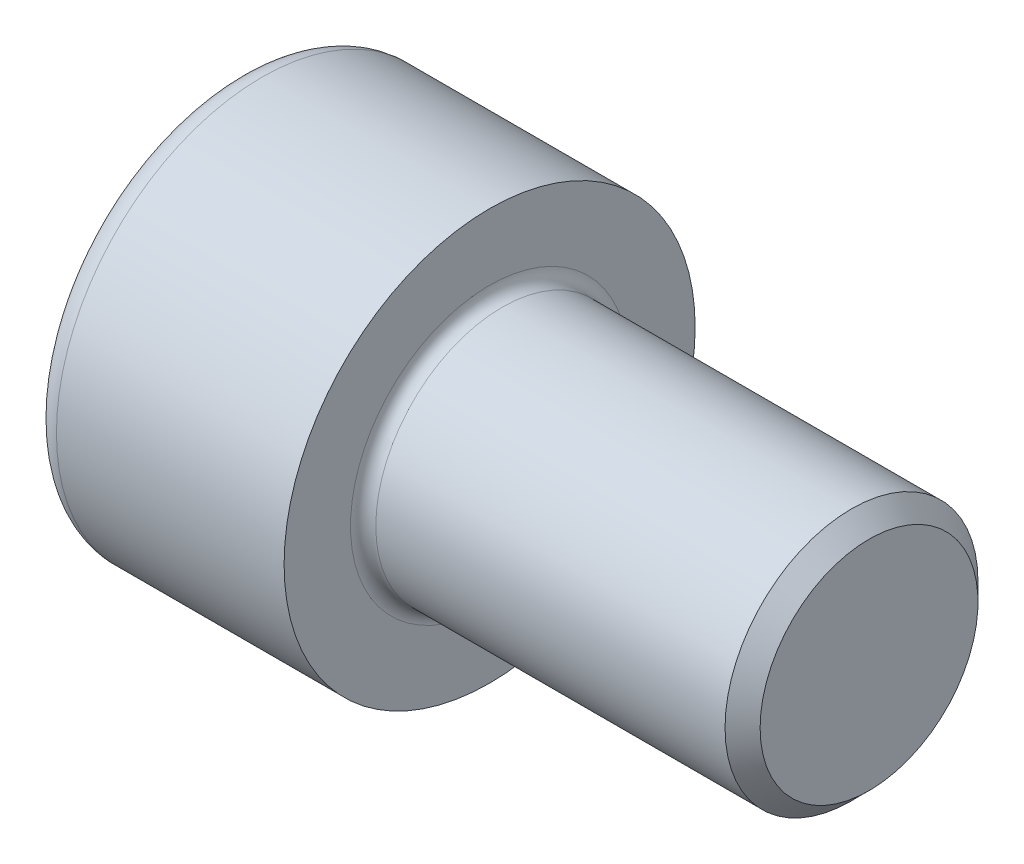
ISO-10303-21;
HEADER;
FILE_DESCRIPTION(('STEP AP214'),'2;1');
FILE_NAME('part.step','',(''),(''),'','','');
FILE_SCHEMA(('AUTOMOTIVE_DESIGN { 1 0 10303 214 1 1 1 1 }'));
ENDSEC;
DATA;
#1=APPLICATION_CONTEXT('core data for automotive mechanical design processes');
#2=APPLICATION_PROTOCOL_DEFINITION('international standard','automotive_design',2000,#1);
#3=PRODUCT_CONTEXT('',#1,'mechanical');
#4=PRODUCT('Part','Part','',(#3));
#5=PRODUCT_RELATED_PRODUCT_CATEGORY('part','',(#4));
#6=PRODUCT_DEFINITION_FORMATION('','',#4);
#7=PRODUCT_DEFINITION_CONTEXT('part definition',#1,'design');
#8=PRODUCT_DEFINITION('design','',#6,#7);
#9=PRODUCT_DEFINITION_SHAPE('','',#8);
#10=(LENGTH_UNIT() NAMED_UNIT(*) SI_UNIT(.MILLI.,.METRE.));
#11=(NAMED_UNIT(*) PLANE_ANGLE_UNIT() SI_UNIT($,.RADIAN.));
#12=(NAMED_UNIT(*) SI_UNIT($,.STERADIAN.) SOLID_ANGLE_UNIT());
#13=UNCERTAINTY_MEASURE_WITH_UNIT(LENGTH_MEASURE(1.E-05),#10,'distance_accuracy_value','');
#14=(GEOMETRIC_REPRESENTATION_CONTEXT(3) GLOBAL_UNCERTAINTY_ASSIGNED_CONTEXT((#13)) GLOBAL_UNIT_ASSIGNED_CONTEXT((#10,
#11,#12)) REPRESENTATION_CONTEXT('',''));
#15=CARTESIAN_POINT('',(0.,0.,0.));
#16=DIRECTION('',(0.,0.,1.));
#17=DIRECTION('',(1.,0.,0.));
#18=AXIS2_PLACEMENT_3D('',#15,#16,#17);
#19=CARTESIAN_POINT('',(0.,0.,0.));
#20=DIRECTION('',(-1.,0.,0.));
#21=DIRECTION('',(0.,0.,1.));
#22=AXIS2_PLACEMENT_3D('',#19,#20,#21);
#23=PLANE('',#22);
#24=DIRECTION('',(0.,-0.499999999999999,0.866025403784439));
#25=VECTOR('',#24,1.);
#26=CARTESIAN_POINT('',(0.,3.47564862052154,0.));
#27=LINE('',#26,#25);
#28=CARTESIAN_POINT('',(0.,3.47564862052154,0.));
#29=VERTEX_POINT('',#28);
#30=CARTESIAN_POINT('',(0.,1.73782431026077,3.00999999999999));
#31=VERTEX_POINT('',#30);
#32=EDGE_CURVE('E259',#29,#31,#27,.T.);
#33=ORIENTED_EDGE('',*,*,#32,.T.);
#34=DIRECTION('',(0.,1.,0.));
#35=VECTOR('',#34,1.);
#36=CARTESIAN_POINT('',(0.,-1.73782431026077,3.01));
#37=LINE('',#36,#35);
#38=CARTESIAN_POINT('',(0.,-1.73782431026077,3.01));
#39=VERTEX_POINT('',#38);
#40=EDGE_CURVE('E131',#39,#31,#37,.T.);
#41=ORIENTED_EDGE('',*,*,#40,.F.);
#42=DIRECTION('',(0.,-0.500000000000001,-0.866025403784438));
#43=VECTOR('',#42,1.);
#44=CARTESIAN_POINT('',(0.,-1.73782431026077,3.01));
#45=LINE('',#44,#43);
#46=CARTESIAN_POINT('',(0.,-3.47564862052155,0.));
#47=VERTEX_POINT('',#46);
#48=EDGE_CURVE('E262',#39,#47,#45,.T.);
#49=ORIENTED_EDGE('',*,*,#48,.T.);
#50=DIRECTION('',(0.,0.499999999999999,-0.866025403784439));
#51=VECTOR('',#50,1.);
#52=CARTESIAN_POINT('',(0.,-3.47564862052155,0.));
#53=LINE('',#52,#51);
#54=CARTESIAN_POINT('',(0.,-1.73782431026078,-3.01));
#55=VERTEX_POINT('',#54);
#56=EDGE_CURVE('E265',#47,#55,#53,.T.);
#57=ORIENTED_EDGE('',*,*,#56,.T.);
#58=DIRECTION('',(0.,-1.,0.));
#59=VECTOR('',#58,1.);
#60=CARTESIAN_POINT('',(0.,1.73782431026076,-3.01));
#61=LINE('',#60,#59);
#62=CARTESIAN_POINT('',(0.,1.73782431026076,-3.01));
#63=VERTEX_POINT('',#62);
#64=EDGE_CURVE('E268',#63,#55,#61,.T.);
#65=ORIENTED_EDGE('',*,*,#64,.F.);
#66=DIRECTION('',(0.,-0.500000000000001,-0.866025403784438));
#67=VECTOR('',#66,1.);
#68=CARTESIAN_POINT('',(0.,3.47564862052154,0.));
#69=LINE('',#68,#67);
#70=EDGE_CURVE('E126',#29,#63,#69,.T.);
#71=ORIENTED_EDGE('',*,*,#70,.F.);
#72=EDGE_LOOP('',(#33,#41,#49,#57,#65,#71));
#73=FACE_BOUND('',#72,.T.);
#74=CARTESIAN_POINT('',(0.,0.,0.));
#75=DIRECTION('',(-1.,0.,0.));
#76=DIRECTION('',(0.,0.,1.));
#77=AXIS2_PLACEMENT_3D('',#74,#75,#76);
#78=CIRCLE('',#77,5.7);
#79=CARTESIAN_POINT('',(0.,0.,5.7));
#80=VERTEX_POINT('',#79);
#81=EDGE_CURVE('E43',#80,#80,#78,.T.);
#82=ORIENTED_EDGE('',*,*,#81,.T.);
#83=EDGE_LOOP('',(#82));
#84=FACE_BOUND('',#83,.T.);
#85=ADVANCED_FACE('F35',(#73,#84),#23,.T.);
#86=CARTESIAN_POINT('',(-31.75,0.,0.));
#87=DIRECTION('',(-1.,0.,0.));
#88=DIRECTION('',(0.,0.,1.));
#89=AXIS2_PLACEMENT_3D('',#86,#87,#88);
#90=CYLINDRICAL_SURFACE('',#89,6.5);
#91=CARTESIAN_POINT('',(0.800000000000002,0.,0.));
#92=DIRECTION('',(-1.,0.,0.));
#93=DIRECTION('',(0.,0.,1.));
#94=AXIS2_PLACEMENT_3D('',#91,#92,#93);
#95=CIRCLE('',#94,6.5);
#96=CARTESIAN_POINT('',(0.800000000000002,0.,6.5));
#97=VERTEX_POINT('',#96);
#98=EDGE_CURVE('E11',#97,#97,#95,.F.);
#99=ORIENTED_EDGE('',*,*,#98,.T.);
#100=EDGE_LOOP('',(#99));
#101=FACE_BOUND('',#100,.T.);
#102=CARTESIAN_POINT('',(8.,0.,0.));
#103=DIRECTION('',(-1.,0.,0.));
#104=DIRECTION('',(0.,0.,1.));
#105=AXIS2_PLACEMENT_3D('',#102,#103,#104);
#106=CIRCLE('',#105,6.5);
#107=CARTESIAN_POINT('',(8.,0.,6.5));
#108=VERTEX_POINT('',#107);
#109=EDGE_CURVE('E149',#108,#108,#106,.T.);
#110=ORIENTED_EDGE('',*,*,#109,.T.);
#111=EDGE_LOOP('',(#110));
#112=FACE_BOUND('',#111,.T.);
#113=ADVANCED_FACE('F173',(#101,#112),#90,.T.);
#114=CARTESIAN_POINT('',(8.,6.5,0.));
#115=DIRECTION('',(1.,0.,0.));
#116=DIRECTION('',(0.,0.,-1.));
#117=AXIS2_PLACEMENT_3D('',#114,#115,#116);
#118=PLANE('',#117);
#119=CARTESIAN_POINT('',(8.,0.,0.));
#120=DIRECTION('',(1.,0.,0.));
#121=DIRECTION('',(0.,0.,-1.));
#122=AXIS2_PLACEMENT_3D('',#119,#120,#121);
#123=CIRCLE('',#122,4.4);
#124=CARTESIAN_POINT('',(8.,0.,-4.4));
#125=VERTEX_POINT('',#124);
#126=EDGE_CURVE('E152',#125,#125,#123,.F.);
#127=ORIENTED_EDGE('',*,*,#126,.T.);
#128=EDGE_LOOP('',(#127));
#129=FACE_BOUND('',#128,.T.);
#130=ORIENTED_EDGE('',*,*,#109,.F.);
#131=EDGE_LOOP('',(#130));
#132=FACE_BOUND('',#131,.T.);
#133=ADVANCED_FACE('F179',(#129,#132),#118,.T.);
#134=CARTESIAN_POINT('',(-31.75,0.,0.));
#135=DIRECTION('',(-1.,0.,0.));
#136=DIRECTION('',(0.,0.,1.));
#137=AXIS2_PLACEMENT_3D('',#134,#135,#136);
#138=CYLINDRICAL_SURFACE('',#137,4.);
#139=CARTESIAN_POINT('',(8.4,0.,0.));
#140=DIRECTION('',(1.,0.,0.));
#141=DIRECTION('',(0.,0.,-1.));
#142=AXIS2_PLACEMENT_3D('',#139,#140,#141);
#143=CIRCLE('',#142,4.);
#144=CARTESIAN_POINT('',(8.4,0.,-4.));
#145=VERTEX_POINT('',#144);
#146=EDGE_CURVE('E155',#145,#145,#143,.T.);
#147=ORIENTED_EDGE('',*,*,#146,.T.);
#148=EDGE_LOOP('',(#147));
#149=FACE_BOUND('',#148,.T.);
#150=CARTESIAN_POINT('',(19.4455,0.,0.));
#151=DIRECTION('',(-1.,0.,0.));
#152=DIRECTION('',(0.,0.,1.));
#153=AXIS2_PLACEMENT_3D('',#150,#151,#152);
#154=CIRCLE('',#153,4.);
#155=CARTESIAN_POINT('',(19.4455,0.,4.));
#156=VERTEX_POINT('',#155);
#157=EDGE_CURVE('E146',#156,#156,#154,.T.);
#158=ORIENTED_EDGE('',*,*,#157,.T.);
#159=EDGE_LOOP('',(#158));
#160=FACE_BOUND('',#159,.T.);
#161=ADVANCED_FACE('F185',(#149,#160),#138,.T.);
#162=CARTESIAN_POINT('',(20.,0.,0.));
#163=DIRECTION('',(-1.,0.,0.));
#164=DIRECTION('',(0.,0.,1.));
#165=AXIS2_PLACEMENT_3D('',#162,#163,#164);
#166=CONICAL_SURFACE('',#165,3.4455,0.785398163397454);
#167=ORIENTED_EDGE('',*,*,#157,.F.);
#168=EDGE_LOOP('',(#167));
#169=FACE_BOUND('',#168,.T.);
#170=CARTESIAN_POINT('',(20.,0.,0.));
#171=DIRECTION('',(-1.,0.,0.));
#172=DIRECTION('',(0.,0.,1.));
#173=AXIS2_PLACEMENT_3D('',#170,#171,#172);
#174=CIRCLE('',#173,3.4455);
#175=CARTESIAN_POINT('',(20.,0.,3.4455));
#176=VERTEX_POINT('',#175);
#177=EDGE_CURVE('E142',#176,#176,#174,.T.);
#178=ORIENTED_EDGE('',*,*,#177,.T.);
#179=EDGE_LOOP('',(#178));
#180=FACE_BOUND('',#179,.T.);
#181=ADVANCED_FACE('F189',(#169,#180),#166,.T.);
#182=CARTESIAN_POINT('',(20.,3.4455,0.));
#183=DIRECTION('',(1.,0.,0.));
#184=DIRECTION('',(0.,0.,-1.));
#185=AXIS2_PLACEMENT_3D('',#182,#183,#184);
#186=PLANE('',#185);
#187=ORIENTED_EDGE('',*,*,#177,.F.);
#188=EDGE_LOOP('',(#187));
#189=FACE_BOUND('',#188,.T.);
#190=ADVANCED_FACE('F169',(#189),#186,.T.);
#191=CARTESIAN_POINT('',(8.4,0.,0.));
#192=DIRECTION('',(1.,0.,0.));
#193=DIRECTION('',(0.,0.,-1.));
#194=AXIS2_PLACEMENT_3D('',#191,#192,#193);
#195=TOROIDAL_SURFACE('',#194,4.4,0.4);
#196=ORIENTED_EDGE('',*,*,#146,.F.);
#197=EDGE_LOOP('',(#196));
#198=FACE_BOUND('',#197,.T.);
#199=ORIENTED_EDGE('',*,*,#126,.F.);
#200=EDGE_LOOP('',(#199));
#201=FACE_BOUND('',#200,.T.);
#202=ADVANCED_FACE('F162',(#198,#201),#195,.F.);
#203=CARTESIAN_POINT('',(0.800000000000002,0.,0.));
#204=DIRECTION('',(-1.,0.,0.));
#205=DIRECTION('',(0.,0.,1.));
#206=AXIS2_PLACEMENT_3D('',#203,#204,#205);
#207=TOROIDAL_SURFACE('',#206,5.7,0.8);
#208=ORIENTED_EDGE('',*,*,#98,.F.);
#209=EDGE_LOOP('',(#208));
#210=FACE_BOUND('',#209,.T.);
#211=ORIENTED_EDGE('',*,*,#81,.F.);
#212=EDGE_LOOP('',(#211));
#213=FACE_BOUND('',#212,.T.);
#214=ADVANCED_FACE('F37',(#210,#213),#207,.T.);
#215=CARTESIAN_POINT('',(4.,3.47564862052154,0.));
#216=DIRECTION('',(0.,-0.866025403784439,-0.499999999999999));
#217=DIRECTION('',(0.,0.499999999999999,-0.866025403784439));
#218=AXIS2_PLACEMENT_3D('',#215,#216,#217);
#219=PLANE('',#218);
#220=ORIENTED_EDGE('',*,*,#32,.F.);
#221=DIRECTION('',(-1.,0.,0.));
#222=VECTOR('',#221,1.);
#223=CARTESIAN_POINT('',(4.,3.47564862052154,0.));
#224=LINE('',#223,#222);
#225=CARTESIAN_POINT('',(4.,3.47564862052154,0.));
#226=VERTEX_POINT('',#225);
#227=EDGE_CURVE('E249',#226,#29,#224,.T.);
#228=ORIENTED_EDGE('',*,*,#227,.F.);
#229=DIRECTION('',(0.,-0.499999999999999,0.866025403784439));
#230=VECTOR('',#229,1.);
#231=CARTESIAN_POINT('',(4.,3.47564862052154,0.));
#232=LINE('',#231,#230);
#233=CARTESIAN_POINT('',(4.,2.60673646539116,1.50499999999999));
#234=VERTEX_POINT('',#233);
#235=EDGE_CURVE('E118',#226,#234,#232,.T.);
#236=ORIENTED_EDGE('',*,*,#235,.T.);
#237=CARTESIAN_POINT('',(4.,1.73782431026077,3.00999999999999));
#238=VERTEX_POINT('',#237);
#239=EDGE_CURVE('E109',#234,#238,#232,.T.);
#240=ORIENTED_EDGE('',*,*,#239,.T.);
#241=DIRECTION('',(-1.,0.,0.));
#242=VECTOR('',#241,1.);
#243=CARTESIAN_POINT('',(4.,1.73782431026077,3.00999999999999));
#244=LINE('',#243,#242);
#245=EDGE_CURVE('E123',#238,#31,#244,.T.);
#246=ORIENTED_EDGE('',*,*,#245,.T.);
#247=EDGE_LOOP('',(#220,#228,#236,#240,#246));
#248=FACE_BOUND('',#247,.T.);
#249=ADVANCED_FACE('F122',(#248),#219,.T.);
#250=CARTESIAN_POINT('',(4.,-1.73782431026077,3.01));
#251=DIRECTION('',(0.,0.,1.));
#252=DIRECTION('',(0.,-1.,0.));
#253=AXIS2_PLACEMENT_3D('',#250,#251,#252);
#254=PLANE('',#253);
#255=ORIENTED_EDGE('',*,*,#40,.T.);
#256=ORIENTED_EDGE('',*,*,#245,.F.);
#257=DIRECTION('',(0.,1.,0.));
#258=VECTOR('',#257,1.);
#259=CARTESIAN_POINT('',(4.,-1.73782431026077,3.01));
#260=LINE('',#259,#258);
#261=CARTESIAN_POINT('',(4.,0.,3.01));
#262=VERTEX_POINT('',#261);
#263=EDGE_CURVE('E106',#262,#238,#260,.T.);
#264=ORIENTED_EDGE('',*,*,#263,.F.);
#265=CARTESIAN_POINT('',(4.,-1.73782431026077,3.01));
#266=VERTEX_POINT('',#265);
#267=EDGE_CURVE('E117',#266,#262,#260,.T.);
#268=ORIENTED_EDGE('',*,*,#267,.F.);
#269=DIRECTION('',(-1.,0.,0.));
#270=VECTOR('',#269,1.);
#271=CARTESIAN_POINT('',(4.,-1.73782431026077,3.01));
#272=LINE('',#271,#270);
#273=EDGE_CURVE('E133',#266,#39,#272,.T.);
#274=ORIENTED_EDGE('',*,*,#273,.T.);
#275=EDGE_LOOP('',(#255,#256,#264,#268,#274));
#276=FACE_BOUND('',#275,.T.);
#277=ADVANCED_FACE('F128',(#276),#254,.F.);
#278=CARTESIAN_POINT('',(4.,-1.73782431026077,3.01));
#279=DIRECTION('',(0.,0.866025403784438,-0.500000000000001));
#280=DIRECTION('',(0.,0.500000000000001,0.866025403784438));
#281=AXIS2_PLACEMENT_3D('',#278,#279,#280);
#282=PLANE('',#281);
#283=ORIENTED_EDGE('',*,*,#48,.F.);
#284=ORIENTED_EDGE('',*,*,#273,.F.);
#285=DIRECTION('',(0.,-0.500000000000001,-0.866025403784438));
#286=VECTOR('',#285,1.);
#287=CARTESIAN_POINT('',(4.,-1.73782431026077,3.01));
#288=LINE('',#287,#286);
#289=CARTESIAN_POINT('',(4.,-2.60673646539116,1.505));
#290=VERTEX_POINT('',#289);
#291=EDGE_CURVE('E288',#266,#290,#288,.T.);
#292=ORIENTED_EDGE('',*,*,#291,.T.);
#293=CARTESIAN_POINT('',(4.,-3.47564862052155,0.));
#294=VERTEX_POINT('',#293);
#295=EDGE_CURVE('E277',#290,#294,#288,.T.);
#296=ORIENTED_EDGE('',*,*,#295,.T.);
#297=DIRECTION('',(-1.,0.,0.));
#298=VECTOR('',#297,1.);
#299=CARTESIAN_POINT('',(4.,-3.47564862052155,0.));
#300=LINE('',#299,#298);
#301=EDGE_CURVE('E138',#294,#47,#300,.T.);
#302=ORIENTED_EDGE('',*,*,#301,.T.);
#303=EDGE_LOOP('',(#283,#284,#292,#296,#302));
#304=FACE_BOUND('',#303,.T.);
#305=ADVANCED_FACE('F203',(#304),#282,.T.);
#306=CARTESIAN_POINT('',(4.,-3.47564862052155,0.));
#307=DIRECTION('',(0.,0.866025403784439,0.499999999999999));
#308=DIRECTION('',(0.,-0.499999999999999,0.866025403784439));
#309=AXIS2_PLACEMENT_3D('',#306,#307,#308);
#310=PLANE('',#309);
#311=ORIENTED_EDGE('',*,*,#56,.F.);
#312=ORIENTED_EDGE('',*,*,#301,.F.);
#313=DIRECTION('',(0.,0.499999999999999,-0.866025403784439));
#314=VECTOR('',#313,1.);
#315=CARTESIAN_POINT('',(4.,-3.47564862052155,0.));
#316=LINE('',#315,#314);
#317=CARTESIAN_POINT('',(4.,-2.60673646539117,-1.505));
#318=VERTEX_POINT('',#317);
#319=EDGE_CURVE('E255',#294,#318,#316,.T.);
#320=ORIENTED_EDGE('',*,*,#319,.T.);
#321=CARTESIAN_POINT('',(4.,-1.73782431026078,-3.01));
#322=VERTEX_POINT('',#321);
#323=EDGE_CURVE('E287',#318,#322,#316,.T.);
#324=ORIENTED_EDGE('',*,*,#323,.T.);
#325=DIRECTION('',(-1.,0.,0.));
#326=VECTOR('',#325,1.);
#327=CARTESIAN_POINT('',(4.,-1.73782431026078,-3.01));
#328=LINE('',#327,#326);
#329=EDGE_CURVE('E248',#322,#55,#328,.T.);
#330=ORIENTED_EDGE('',*,*,#329,.T.);
#331=EDGE_LOOP('',(#311,#312,#320,#324,#330));
#332=FACE_BOUND('',#331,.T.);
#333=ADVANCED_FACE('F206',(#332),#310,.T.);
#334=CARTESIAN_POINT('',(4.,1.73782431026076,-3.01));
#335=DIRECTION('',(0.,0.,-1.));
#336=DIRECTION('',(0.,1.,0.));
#337=AXIS2_PLACEMENT_3D('',#334,#335,#336);
#338=PLANE('',#337);
#339=ORIENTED_EDGE('',*,*,#64,.T.);
#340=ORIENTED_EDGE('',*,*,#329,.F.);
#341=DIRECTION('',(0.,-1.,0.));
#342=VECTOR('',#341,1.);
#343=CARTESIAN_POINT('',(4.,1.73782431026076,-3.01));
#344=LINE('',#343,#342);
#345=CARTESIAN_POINT('',(4.,0.,-3.01));
#346=VERTEX_POINT('',#345);
#347=EDGE_CURVE('E252',#346,#322,#344,.T.);
#348=ORIENTED_EDGE('',*,*,#347,.F.);
#349=CARTESIAN_POINT('',(4.,1.73782431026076,-3.01));
#350=VERTEX_POINT('',#349);
#351=EDGE_CURVE('E50',#350,#346,#344,.T.);
#352=ORIENTED_EDGE('',*,*,#351,.F.);
#353=DIRECTION('',(-1.,0.,0.));
#354=VECTOR('',#353,1.);
#355=CARTESIAN_POINT('',(4.,1.73782431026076,-3.01));
#356=LINE('',#355,#354);
#357=EDGE_CURVE('E245',#350,#63,#356,.T.);
#358=ORIENTED_EDGE('',*,*,#357,.T.);
#359=EDGE_LOOP('',(#339,#340,#348,#352,#358));
#360=FACE_BOUND('',#359,.T.);
#361=ADVANCED_FACE('F210',(#360),#338,.F.);
#362=CARTESIAN_POINT('',(4.,3.47564862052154,0.));
#363=DIRECTION('',(0.,0.866025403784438,-0.500000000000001));
#364=DIRECTION('',(0.,0.500000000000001,0.866025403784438));
#365=AXIS2_PLACEMENT_3D('',#362,#363,#364);
#366=PLANE('',#365);
#367=ORIENTED_EDGE('',*,*,#70,.T.);
#368=ORIENTED_EDGE('',*,*,#357,.F.);
#369=DIRECTION('',(0.,-0.500000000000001,-0.866025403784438));
#370=VECTOR('',#369,1.);
#371=CARTESIAN_POINT('',(4.,3.47564862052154,0.));
#372=LINE('',#371,#370);
#373=CARTESIAN_POINT('',(4.,2.60673646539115,-1.505));
#374=VERTEX_POINT('',#373);
#375=EDGE_CURVE('E235',#374,#350,#372,.T.);
#376=ORIENTED_EDGE('',*,*,#375,.F.);
#377=EDGE_CURVE('E241',#226,#374,#372,.T.);
#378=ORIENTED_EDGE('',*,*,#377,.F.);
#379=ORIENTED_EDGE('',*,*,#227,.T.);
#380=EDGE_LOOP('',(#367,#368,#376,#378,#379));
#381=FACE_BOUND('',#380,.T.);
#382=ADVANCED_FACE('F214',(#381),#366,.F.);
#383=CARTESIAN_POINT('',(4.,0.,6.02));
#384=DIRECTION('',(1.,0.,0.));
#385=DIRECTION('',(0.,0.,-1.));
#386=AXIS2_PLACEMENT_3D('',#383,#384,#385);
#387=PLANE('',#386);
#388=ORIENTED_EDGE('',*,*,#347,.T.);
#389=ORIENTED_EDGE('',*,*,#323,.F.);
#390=CARTESIAN_POINT('',(4.,0.,0.));
#391=DIRECTION('',(-1.,0.,0.));
#392=DIRECTION('',(0.,0.,1.));
#393=AXIS2_PLACEMENT_3D('',#390,#391,#392);
#394=CIRCLE('',#393,3.01);
#395=EDGE_CURVE('E283',#346,#318,#394,.T.);
#396=ORIENTED_EDGE('',*,*,#395,.F.);
#397=EDGE_LOOP('',(#388,#389,#396));
#398=FACE_BOUND('',#397,.T.);
#399=ADVANCED_FACE('F218',(#398),#387,.F.);
#400=ORIENTED_EDGE('',*,*,#319,.F.);
#401=ORIENTED_EDGE('',*,*,#295,.F.);
#402=EDGE_CURVE('E136',#318,#290,#394,.T.);
#403=ORIENTED_EDGE('',*,*,#402,.F.);
#404=EDGE_LOOP('',(#400,#401,#403));
#405=FACE_BOUND('',#404,.T.);
#406=ADVANCED_FACE('F221',(#405),#387,.F.);
#407=ORIENTED_EDGE('',*,*,#291,.F.);
#408=ORIENTED_EDGE('',*,*,#267,.T.);
#409=EDGE_CURVE('E132',#290,#262,#394,.T.);
#410=ORIENTED_EDGE('',*,*,#409,.F.);
#411=EDGE_LOOP('',(#407,#408,#410));
#412=FACE_BOUND('',#411,.T.);
#413=ADVANCED_FACE('F226',(#412),#387,.F.);
#414=ORIENTED_EDGE('',*,*,#263,.T.);
#415=ORIENTED_EDGE('',*,*,#239,.F.);
#416=EDGE_CURVE('E112',#262,#234,#394,.T.);
#417=ORIENTED_EDGE('',*,*,#416,.F.);
#418=EDGE_LOOP('',(#414,#415,#417));
#419=FACE_BOUND('',#418,.T.);
#420=ADVANCED_FACE('F108',(#419),#387,.F.);
#421=ORIENTED_EDGE('',*,*,#235,.F.);
#422=ORIENTED_EDGE('',*,*,#377,.T.);
#423=EDGE_CURVE('E143',#234,#374,#394,.T.);
#424=ORIENTED_EDGE('',*,*,#423,.F.);
#425=EDGE_LOOP('',(#421,#422,#424));
#426=FACE_BOUND('',#425,.T.);
#427=ADVANCED_FACE('F229',(#426),#387,.F.);
#428=ORIENTED_EDGE('',*,*,#375,.T.);
#429=ORIENTED_EDGE('',*,*,#351,.T.);
#430=EDGE_CURVE('E238',#374,#346,#394,.T.);
#431=ORIENTED_EDGE('',*,*,#430,.F.);
#432=EDGE_LOOP('',(#428,#429,#431));
#433=FACE_BOUND('',#432,.T.);
#434=ADVANCED_FACE('F199',(#433),#387,.F.);
#435=CARTESIAN_POINT('',(4.,0.,0.));
#436=DIRECTION('',(-1.,0.,0.));
#437=DIRECTION('',(0.,0.,1.));
#438=AXIS2_PLACEMENT_3D('',#435,#436,#437);
#439=CONICAL_SURFACE('',#438,3.01,1.04719755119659);
#440=CARTESIAN_POINT('',(5.73782431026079,0.,0.));
#441=VERTEX_POINT('',#440);
#442=VERTEX_LOOP('',#441);
#443=FACE_BOUND('',#442,.T.);
#444=ORIENTED_EDGE('',*,*,#416,.T.);
#445=ORIENTED_EDGE('',*,*,#423,.T.);
#446=ORIENTED_EDGE('',*,*,#430,.T.);
#447=ORIENTED_EDGE('',*,*,#395,.T.);
#448=ORIENTED_EDGE('',*,*,#402,.T.);
#449=ORIENTED_EDGE('',*,*,#409,.T.);
#450=EDGE_LOOP('',(#444,#445,#446,#447,#448,#449));
#451=FACE_BOUND('',#450,.T.);
#452=ADVANCED_FACE('F197',(#443,#451),#439,.F.);
#453=CLOSED_SHELL('',(#85,#113,#133,#161,#181,#190,#202,#214,#249,#277,#305,#333,#361,#382,#399,
#406,#413,#420,#427,#434,#452));
#454=MANIFOLD_SOLID_BREP('B2',#453);
#455=ADVANCED_BREP_SHAPE_REPRESENTATION('',(#18,#454),#14);
#456=SHAPE_DEFINITION_REPRESENTATION(#9,#455);
ENDSEC;
END-ISO-10303-21;
